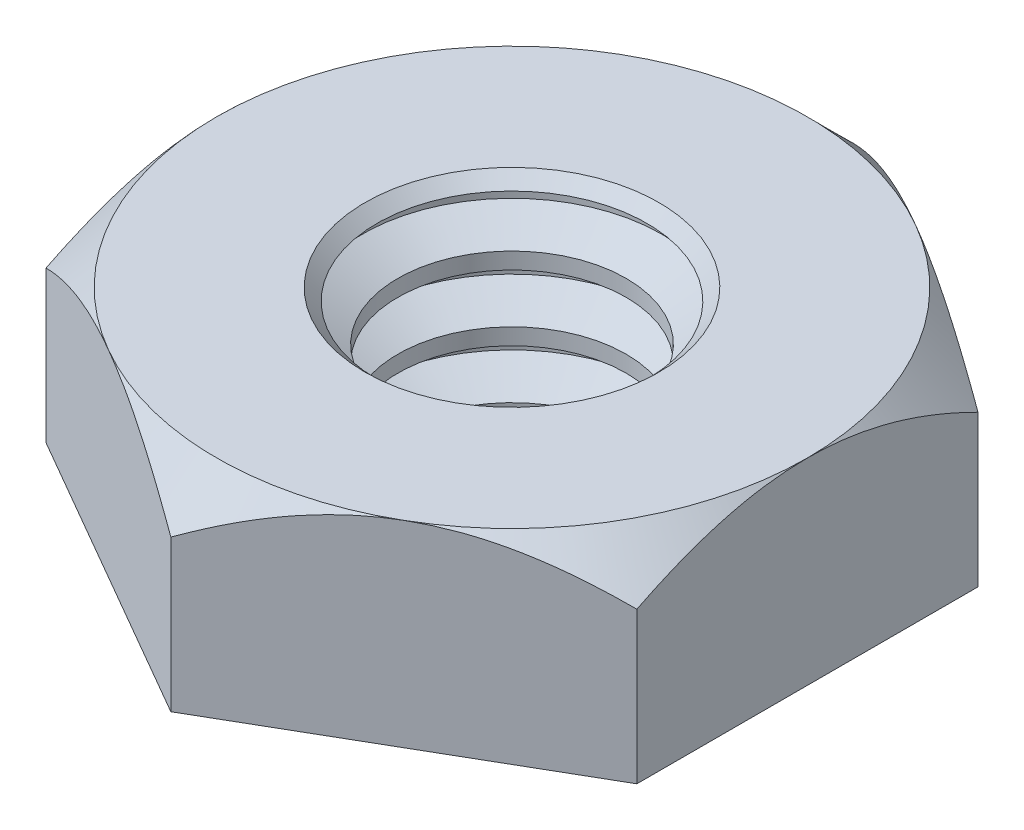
ISO-10303-21;
HEADER;
FILE_DESCRIPTION(('STEP AP214'),'2;1');
FILE_NAME('part.step','',(''),(''),'','','');
FILE_SCHEMA(('AUTOMOTIVE_DESIGN { 1 0 10303 214 1 1 1 1 }'));
ENDSEC;
DATA;
#1=APPLICATION_CONTEXT('core data for automotive mechanical design processes');
#2=APPLICATION_PROTOCOL_DEFINITION('international standard','automotive_design',2000,#1);
#3=PRODUCT_CONTEXT('',#1,'mechanical');
#4=PRODUCT('Part','Part','',(#3));
#5=PRODUCT_RELATED_PRODUCT_CATEGORY('part','',(#4));
#6=PRODUCT_DEFINITION_FORMATION('','',#4);
#7=PRODUCT_DEFINITION_CONTEXT('part definition',#1,'design');
#8=PRODUCT_DEFINITION('design','',#6,#7);
#9=PRODUCT_DEFINITION_SHAPE('','',#8);
#10=(LENGTH_UNIT() NAMED_UNIT(*) SI_UNIT(.MILLI.,.METRE.));
#11=(NAMED_UNIT(*) PLANE_ANGLE_UNIT() SI_UNIT($,.RADIAN.));
#12=(NAMED_UNIT(*) SI_UNIT($,.STERADIAN.) SOLID_ANGLE_UNIT());
#13=UNCERTAINTY_MEASURE_WITH_UNIT(LENGTH_MEASURE(1.E-05),#10,'distance_accuracy_value','');
#14=(GEOMETRIC_REPRESENTATION_CONTEXT(3) GLOBAL_UNCERTAINTY_ASSIGNED_CONTEXT((#13)) GLOBAL_UNIT_ASSIGNED_CONTEXT((#10,
#11,#12)) REPRESENTATION_CONTEXT('',''));
#15=CARTESIAN_POINT('',(0.,0.,0.));
#16=DIRECTION('',(0.,0.,1.));
#17=DIRECTION('',(1.,0.,0.));
#18=AXIS2_PLACEMENT_3D('',#15,#16,#17);
#19=CARTESIAN_POINT('',(0.,0.,-5.49926131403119));
#20=DIRECTION('',(0.,1.,0.));
#21=DIRECTION('',(0.,0.,1.));
#22=AXIS2_PLACEMENT_3D('',#19,#20,#21);
#23=PLANE('',#22);
#24=DIRECTION('',(-0.866025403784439,0.,-0.5));
#25=VECTOR('',#24,1.);
#26=CARTESIAN_POINT('',(4.7625,0.,-2.74963065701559));
#27=LINE('',#26,#25);
#28=CARTESIAN_POINT('',(4.7625,0.,-2.74963065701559));
#29=VERTEX_POINT('',#28);
#30=CARTESIAN_POINT('',(0.,0.,-5.49926131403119));
#31=VERTEX_POINT('',#30);
#32=EDGE_CURVE('E235',#29,#31,#27,.T.);
#33=ORIENTED_EDGE('',*,*,#32,.F.);
#34=DIRECTION('',(0.,0.,-1.));
#35=VECTOR('',#34,1.);
#36=CARTESIAN_POINT('',(4.7625,0.,2.74963065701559));
#37=LINE('',#36,#35);
#38=CARTESIAN_POINT('',(4.7625,0.,2.74963065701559));
#39=VERTEX_POINT('',#38);
#40=EDGE_CURVE('E283',#39,#29,#37,.T.);
#41=ORIENTED_EDGE('',*,*,#40,.F.);
#42=DIRECTION('',(0.866025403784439,0.,-0.5));
#43=VECTOR('',#42,1.);
#44=CARTESIAN_POINT('',(0.,0.,5.49926131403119));
#45=LINE('',#44,#43);
#46=CARTESIAN_POINT('',(0.,0.,5.49926131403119));
#47=VERTEX_POINT('',#46);
#48=EDGE_CURVE('E282',#47,#39,#45,.T.);
#49=ORIENTED_EDGE('',*,*,#48,.F.);
#50=DIRECTION('',(0.866025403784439,0.,0.5));
#51=VECTOR('',#50,1.);
#52=CARTESIAN_POINT('',(-4.7625,0.,2.74963065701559));
#53=LINE('',#52,#51);
#54=CARTESIAN_POINT('',(-4.7625,0.,2.74963065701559));
#55=VERTEX_POINT('',#54);
#56=EDGE_CURVE('E127',#55,#47,#53,.T.);
#57=ORIENTED_EDGE('',*,*,#56,.F.);
#58=DIRECTION('',(0.,0.,1.));
#59=VECTOR('',#58,1.);
#60=CARTESIAN_POINT('',(-4.7625,0.,-2.74963065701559));
#61=LINE('',#60,#59);
#62=CARTESIAN_POINT('',(-4.7625,0.,-2.74963065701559));
#63=VERTEX_POINT('',#62);
#64=EDGE_CURVE('E288',#63,#55,#61,.T.);
#65=ORIENTED_EDGE('',*,*,#64,.F.);
#66=DIRECTION('',(-0.866025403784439,0.,0.5));
#67=VECTOR('',#66,1.);
#68=CARTESIAN_POINT('',(0.,0.,-5.49926131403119));
#69=LINE('',#68,#67);
#70=EDGE_CURVE('E291',#31,#63,#69,.T.);
#71=ORIENTED_EDGE('',*,*,#70,.F.);
#72=EDGE_LOOP('',(#33,#41,#49,#57,#65,#71));
#73=FACE_BOUND('',#72,.T.);
#74=CARTESIAN_POINT('',(0.,0.,0.));
#75=DIRECTION('',(0.,1.,0.));
#76=DIRECTION('',(0.,0.,1.));
#77=AXIS2_PLACEMENT_3D('',#74,#75,#76);
#78=CIRCLE('',#77,1.84016027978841);
#79=CARTESIAN_POINT('',(0.,0.,1.84016027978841));
#80=VERTEX_POINT('',#79);
#81=EDGE_CURVE('E238',#80,#80,#78,.T.);
#82=ORIENTED_EDGE('',*,*,#81,.T.);
#83=EDGE_LOOP('',(#82));
#84=FACE_BOUND('',#83,.T.);
#85=ADVANCED_FACE('F33',(#73,#84),#23,.F.);
#86=CARTESIAN_POINT('',(0.,3.175,-5.49926131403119));
#87=DIRECTION('',(0.,1.,0.));
#88=DIRECTION('',(0.,0.,1.));
#89=AXIS2_PLACEMENT_3D('',#86,#87,#88);
#90=PLANE('',#89);
#91=CARTESIAN_POINT('',(0.,3.175,0.));
#92=DIRECTION('',(0.,1.,0.));
#93=DIRECTION('',(0.,0.,1.));
#94=AXIS2_PLACEMENT_3D('',#91,#92,#93);
#95=CIRCLE('',#94,2.36932694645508);
#96=CARTESIAN_POINT('',(0.,3.175,2.36932694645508));
#97=VERTEX_POINT('',#96);
#98=EDGE_CURVE('E11',#97,#97,#95,.F.);
#99=ORIENTED_EDGE('',*,*,#98,.T.);
#100=EDGE_LOOP('',(#99));
#101=FACE_BOUND('',#100,.T.);
#102=CARTESIAN_POINT('',(0.,3.175,0.));
#103=DIRECTION('',(0.,1.,0.));
#104=DIRECTION('',(0.,0.,1.));
#105=AXIS2_PLACEMENT_3D('',#102,#103,#104);
#106=CIRCLE('',#105,4.7625);
#107=CARTESIAN_POINT('',(-2.38125,3.175,4.12444598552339));
#108=VERTEX_POINT('',#107);
#109=CARTESIAN_POINT('',(2.38125,3.175,4.12444598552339));
#110=VERTEX_POINT('',#109);
#111=EDGE_CURVE('E109',#108,#110,#106,.T.);
#112=ORIENTED_EDGE('',*,*,#111,.T.);
#113=CARTESIAN_POINT('',(0.,3.175,0.));
#114=DIRECTION('',(0.,1.,0.));
#115=DIRECTION('',(0.,0.,1.));
#116=AXIS2_PLACEMENT_3D('',#113,#114,#115);
#117=CIRCLE('',#116,4.7625);
#118=CARTESIAN_POINT('',(4.7625,3.175,0.));
#119=VERTEX_POINT('',#118);
#120=EDGE_CURVE('E49',#110,#119,#117,.T.);
#121=ORIENTED_EDGE('',*,*,#120,.T.);
#122=CARTESIAN_POINT('',(2.38125,3.175,-4.12444598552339));
#123=VERTEX_POINT('',#122);
#124=EDGE_CURVE('E142',#119,#123,#106,.T.);
#125=ORIENTED_EDGE('',*,*,#124,.T.);
#126=CARTESIAN_POINT('',(-2.38125,3.175,-4.12444598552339));
#127=VERTEX_POINT('',#126);
#128=EDGE_CURVE('E146',#123,#127,#106,.T.);
#129=ORIENTED_EDGE('',*,*,#128,.T.);
#130=CARTESIAN_POINT('',(-4.7625,3.175,0.));
#131=VERTEX_POINT('',#130);
#132=EDGE_CURVE('E149',#127,#131,#106,.T.);
#133=ORIENTED_EDGE('',*,*,#132,.T.);
#134=EDGE_CURVE('E141',#131,#108,#106,.T.);
#135=ORIENTED_EDGE('',*,*,#134,.T.);
#136=EDGE_LOOP('',(#112,#121,#125,#129,#133,#135));
#137=FACE_BOUND('',#136,.T.);
#138=ADVANCED_FACE('F156',(#101,#137),#90,.T.);
#139=CARTESIAN_POINT('',(4.7625,3.175,-2.74963065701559));
#140=DIRECTION('',(-0.5,0.,0.866025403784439));
#141=DIRECTION('',(0.866025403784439,0.,0.5));
#142=AXIS2_PLACEMENT_3D('',#139,#140,#141);
#143=PLANE('',#142);
#144=CARTESIAN_POINT('',(4.7627,2.43812321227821,-2.74951518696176));
#145=CARTESIAN_POINT('',(4.68081065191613,2.48539793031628,-2.79679402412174));
#146=CARTESIAN_POINT('',(4.5982918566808,2.53122188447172,-2.84443627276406));
#147=CARTESIAN_POINT('',(4.43187187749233,2.61952693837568,-2.94051889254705));
#148=CARTESIAN_POINT('',(4.34796996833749,2.66200621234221,-2.98895968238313));
#149=CARTESIAN_POINT('',(4.09322481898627,2.78412729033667,-3.1360368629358));
#150=CARTESIAN_POINT('',(3.92022499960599,2.85793135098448,-3.23591835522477));
#151=CARTESIAN_POINT('',(3.57135699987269,2.98431583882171,-3.43733738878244));
#152=CARTESIAN_POINT('',(3.39557799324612,3.03721468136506,-3.53882344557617));
#153=CARTESIAN_POINT('',(3.12901952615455,3.09840573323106,-3.69272104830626));
#154=CARTESIAN_POINT('',(3.03977424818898,3.11576836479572,-3.74424683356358));
#155=CARTESIAN_POINT('',(2.8605280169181,3.14404831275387,-3.84773469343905));
#156=CARTESIAN_POINT('',(2.77052717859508,3.15496659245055,-3.89969670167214));
#157=CARTESIAN_POINT('',(2.55120982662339,3.17327251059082,-4.02631963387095));
#158=CARTESIAN_POINT('',(2.42165701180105,3.17711359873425,-4.1011169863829));
#159=CARTESIAN_POINT('',(2.16278485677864,3.17066760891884,-4.25057689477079));
#160=CARTESIAN_POINT('',(2.03346561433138,3.16037557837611,-4.32523939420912));
#161=CARTESIAN_POINT('',(1.77604630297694,3.12627002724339,-4.47386050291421));
#162=CARTESIAN_POINT('',(1.64794776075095,3.10244138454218,-4.54781823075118));
#163=CARTESIAN_POINT('',(1.39395236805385,3.0425580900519,-4.69446253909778));
#164=CARTESIAN_POINT('',(1.26805534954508,3.00650437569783,-4.76714921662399));
#165=CARTESIAN_POINT('',(1.04456117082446,2.93232926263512,-4.89618364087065));
#166=CARTESIAN_POINT('',(0.946469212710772,2.89615832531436,-4.95281705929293));
#167=CARTESIAN_POINT('',(0.752046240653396,2.81798737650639,-5.0650672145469));
#168=CARTESIAN_POINT('',(0.655715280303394,2.77598718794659,-5.12068392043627));
#169=CARTESIAN_POINT('',(0.465117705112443,2.68709929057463,-5.23072548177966));
#170=CARTESIAN_POINT('',(0.370845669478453,2.64022695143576,-5.28515346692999));
#171=CARTESIAN_POINT('',(0.184047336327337,2.54221019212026,-5.39300153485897));
#172=CARTESIAN_POINT('',(0.0915200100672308,2.49106839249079,-5.44642221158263));
#173=CARTESIAN_POINT('',(-0.000200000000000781,2.43812321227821,-5.49937678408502));
#174=B_SPLINE_CURVE_WITH_KNOTS('',3,(#144,#145,#146,#147,#148,#149,#150,#151,#152,#153,#154,
#155,#156,#157,#158,#159,#160,#161,#162,#163,#164,#165,#166,#167,#168,#169,#170,#171,#172,#173),
.UNSPECIFIED.,.F.,.F.,(4,2,2,2,2,2,2,2,2,2,2,2,2,2,4),(0.,0.317131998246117,0.634435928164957,
1.2724696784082,1.90037160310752,2.21370673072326,2.52699500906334,2.97522950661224,
3.42362111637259,3.87251462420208,4.32137371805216,4.67791268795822,5.03446249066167,
5.38991982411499,5.74516056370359),.UNSPECIFIED.);
#175=CARTESIAN_POINT('',(4.7625,2.43823868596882,-2.7496306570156));
#176=VERTEX_POINT('',#175);
#177=EDGE_CURVE('E293',#176,#123,#174,.T.);
#178=ORIENTED_EDGE('',*,*,#177,.F.);
#179=DIRECTION('',(0.,-1.,0.));
#180=VECTOR('',#179,1.);
#181=CARTESIAN_POINT('',(4.7625,3.175,-2.74963065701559));
#182=LINE('',#181,#180);
#183=EDGE_CURVE('E134',#176,#29,#182,.T.);
#184=ORIENTED_EDGE('',*,*,#183,.T.);
#185=ORIENTED_EDGE('',*,*,#32,.T.);
#186=DIRECTION('',(0.,-1.,0.));
#187=VECTOR('',#186,1.);
#188=CARTESIAN_POINT('',(0.,3.175,-5.49926131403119));
#189=LINE('',#188,#187);
#190=CARTESIAN_POINT('',(0.,2.43823868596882,-5.49926131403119));
#191=VERTEX_POINT('',#190);
#192=EDGE_CURVE('E139',#191,#31,#189,.T.);
#193=ORIENTED_EDGE('',*,*,#192,.F.);
#194=EDGE_CURVE('E207',#123,#191,#174,.T.);
#195=ORIENTED_EDGE('',*,*,#194,.F.);
#196=EDGE_LOOP('',(#178,#184,#185,#193,#195));
#197=FACE_BOUND('',#196,.T.);
#198=ADVANCED_FACE('F35',(#197),#143,.F.);
#199=CARTESIAN_POINT('',(0.,3.175,-5.49926131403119));
#200=DIRECTION('',(0.5,0.,0.866025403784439));
#201=DIRECTION('',(0.866025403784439,0.,-0.5));
#202=AXIS2_PLACEMENT_3D('',#199,#200,#201);
#203=PLANE('',#202);
#204=CARTESIAN_POINT('',(0.000199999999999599,2.43812321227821,-5.49937678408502));
#205=CARTESIAN_POINT('',(-0.0816893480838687,2.48539793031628,-5.45209794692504));
#206=CARTESIAN_POINT('',(-0.164208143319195,2.53122188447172,-5.40445569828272));
#207=CARTESIAN_POINT('',(-0.330628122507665,2.61952693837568,-5.30837307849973));
#208=CARTESIAN_POINT('',(-0.41453003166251,2.66200621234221,-5.25993228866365));
#209=CARTESIAN_POINT('',(-0.669275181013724,2.78412729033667,-5.11285510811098));
#210=CARTESIAN_POINT('',(-0.842275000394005,2.85793135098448,-5.01297361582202));
#211=CARTESIAN_POINT('',(-1.19114300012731,2.98431583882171,-4.81155458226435));
#212=CARTESIAN_POINT('',(-1.36692200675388,3.03721468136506,-4.71006852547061));
#213=CARTESIAN_POINT('',(-1.63348047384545,3.09840573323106,-4.55617092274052));
#214=CARTESIAN_POINT('',(-1.72272575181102,3.11576836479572,-4.5046451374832));
#215=CARTESIAN_POINT('',(-1.90197198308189,3.14404831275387,-4.40115727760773));
#216=CARTESIAN_POINT('',(-1.99197282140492,3.15496659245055,-4.34919526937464));
#217=CARTESIAN_POINT('',(-2.21129017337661,3.17327251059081,-4.22257233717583));
#218=CARTESIAN_POINT('',(-2.34084298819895,3.17711359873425,-4.14777498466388));
#219=CARTESIAN_POINT('',(-2.59971514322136,3.17066760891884,-3.99831507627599));
#220=CARTESIAN_POINT('',(-2.72903438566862,3.16037557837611,-3.92365257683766));
#221=CARTESIAN_POINT('',(-2.98645369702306,3.12627002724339,-3.77503146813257));
#222=CARTESIAN_POINT('',(-3.11455223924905,3.10244138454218,-3.7010737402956));
#223=CARTESIAN_POINT('',(-3.36854763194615,3.04255809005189,-3.554429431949));
#224=CARTESIAN_POINT('',(-3.49444465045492,3.00650437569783,-3.48174275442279));
#225=CARTESIAN_POINT('',(-3.71793882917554,2.93232926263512,-3.35270833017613));
#226=CARTESIAN_POINT('',(-3.81603078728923,2.89615832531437,-3.29607491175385));
#227=CARTESIAN_POINT('',(-4.0104537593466,2.81798737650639,-3.18382475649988));
#228=CARTESIAN_POINT('',(-4.10678471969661,2.77598718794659,-3.12820805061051));
#229=CARTESIAN_POINT('',(-4.29738229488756,2.68709929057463,-3.01816648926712));
#230=CARTESIAN_POINT('',(-4.39165433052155,2.64022695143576,-2.96373850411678));
#231=CARTESIAN_POINT('',(-4.57845266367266,2.54221019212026,-2.85589043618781));
#232=CARTESIAN_POINT('',(-4.67097998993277,2.49106839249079,-2.80246975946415));
#233=CARTESIAN_POINT('',(-4.7627,2.43812321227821,-2.74951518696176));
#234=B_SPLINE_CURVE_WITH_KNOTS('',3,(#204,#205,#206,#207,#208,#209,#210,#211,#212,#213,#214,
#215,#216,#217,#218,#219,#220,#221,#222,#223,#224,#225,#226,#227,#228,#229,#230,#231,#232,#233),
.UNSPECIFIED.,.F.,.F.,(4,2,2,2,2,2,2,2,2,2,2,2,2,2,4),(0.,0.317131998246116,0.634435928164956,
1.2724696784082,1.90037160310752,2.21370673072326,2.52699500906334,2.97522950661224,
3.42362111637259,3.87251462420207,4.32137371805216,4.67791268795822,5.03446249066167,
5.38991982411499,5.74516056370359),.UNSPECIFIED.);
#235=EDGE_CURVE('E206',#191,#127,#234,.T.);
#236=ORIENTED_EDGE('',*,*,#235,.F.);
#237=ORIENTED_EDGE('',*,*,#192,.T.);
#238=ORIENTED_EDGE('',*,*,#70,.T.);
#239=DIRECTION('',(0.,-1.,0.));
#240=VECTOR('',#239,1.);
#241=CARTESIAN_POINT('',(-4.7625,3.175,-2.74963065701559));
#242=LINE('',#241,#240);
#243=CARTESIAN_POINT('',(-4.7625,2.43823868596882,-2.74963065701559));
#244=VERTEX_POINT('',#243);
#245=EDGE_CURVE('E132',#244,#63,#242,.T.);
#246=ORIENTED_EDGE('',*,*,#245,.F.);
#247=EDGE_CURVE('E202',#127,#244,#234,.T.);
#248=ORIENTED_EDGE('',*,*,#247,.F.);
#249=EDGE_LOOP('',(#236,#237,#238,#246,#248));
#250=FACE_BOUND('',#249,.T.);
#251=ADVANCED_FACE('F212',(#250),#203,.F.);
#252=CARTESIAN_POINT('',(-4.7625,3.175,-2.74963065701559));
#253=DIRECTION('',(1.,0.,0.));
#254=DIRECTION('',(0.,0.,-1.));
#255=AXIS2_PLACEMENT_3D('',#252,#253,#254);
#256=PLANE('',#255);
#257=CARTESIAN_POINT('',(-4.7625,0.480359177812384,-5.73825260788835));
#258=CARTESIAN_POINT('',(-4.7625,0.58701337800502,-5.59961911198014));
#259=CARTESIAN_POINT('',(-4.7625,0.692711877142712,-5.46023863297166));
#260=CARTESIAN_POINT('',(-4.7625,0.901760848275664,-5.1796783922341));
#261=CARTESIAN_POINT('',(-4.7625,1.00511075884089,-5.03849821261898));
#262=CARTESIAN_POINT('',(-4.7625,1.2097614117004,-4.75300155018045));
#263=CARTESIAN_POINT('',(-4.7625,1.31104019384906,-4.60866927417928));
#264=CARTESIAN_POINT('',(-4.7625,1.51007322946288,-4.31760261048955));
#265=CARTESIAN_POINT('',(-4.7625,1.6078277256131,-4.17086838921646));
#266=CARTESIAN_POINT('',(-4.7625,1.80507075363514,-3.86520042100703));
#267=CARTESIAN_POINT('',(-4.7625,1.90427620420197,-3.70608308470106));
#268=CARTESIAN_POINT('',(-4.7625,2.09652957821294,-3.38411178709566));
#269=CARTESIAN_POINT('',(-4.7625,2.18957646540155,-3.22125720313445));
#270=CARTESIAN_POINT('',(-4.7625,2.36753114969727,-2.89176685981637));
#271=CARTESIAN_POINT('',(-4.7625,2.4524628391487,-2.72514410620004));
#272=CARTESIAN_POINT('',(-4.7625,2.61228425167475,-2.3871883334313));
#273=CARTESIAN_POINT('',(-4.7625,2.68717871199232,-2.2158575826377));
#274=CARTESIAN_POINT('',(-4.7625,2.81744904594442,-1.88527007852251));
#275=CARTESIAN_POINT('',(-4.7625,2.87402159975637,-1.72648972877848));
#276=CARTESIAN_POINT('',(-4.7625,2.97445731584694,-1.40488378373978));
#277=CARTESIAN_POINT('',(-4.7625,3.01831966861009,-1.24205793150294));
#278=CARTESIAN_POINT('',(-4.7625,3.09022963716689,-0.916169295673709));
#279=CARTESIAN_POINT('',(-4.7625,3.11856448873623,-0.753170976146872));
#280=CARTESIAN_POINT('',(-4.7625,3.1588283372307,-0.425149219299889));
#281=CARTESIAN_POINT('',(-4.7625,3.17076073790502,-0.260126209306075));
#282=CARTESIAN_POINT('',(-4.7625,3.17720325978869,0.0630444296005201));
#283=CARTESIAN_POINT('',(-4.7625,3.17245171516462,0.221177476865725));
#284=CARTESIAN_POINT('',(-4.7625,3.14748365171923,0.536209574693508));
#285=CARTESIAN_POINT('',(-4.7625,3.12726572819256,0.693108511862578));
#286=CARTESIAN_POINT('',(-4.7625,3.07216443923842,1.00719592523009));
#287=CARTESIAN_POINT('',(-4.7625,3.03702215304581,1.16433820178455));
#288=CARTESIAN_POINT('',(-4.7625,2.95402178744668,1.47516220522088));
#289=CARTESIAN_POINT('',(-4.7625,2.90616443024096,1.62884412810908));
#290=CARTESIAN_POINT('',(-4.7625,2.79677235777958,1.94121388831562));
#291=CARTESIAN_POINT('',(-4.7625,2.73460754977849,2.09967854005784));
#292=CARTESIAN_POINT('',(-4.7625,2.60067388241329,2.41253183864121));
#293=CARTESIAN_POINT('',(-4.7625,2.52890069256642,2.56691860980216));
#294=CARTESIAN_POINT('',(-4.7625,2.37745234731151,2.87234524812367));
#295=CARTESIAN_POINT('',(-4.7625,2.29775285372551,3.02337294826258));
#296=CARTESIAN_POINT('',(-4.7625,2.13220577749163,3.3219676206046));
#297=CARTESIAN_POINT('',(-4.7625,2.04635914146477,3.46953512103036));
#298=CARTESIAN_POINT('',(-4.7625,1.874079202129,3.75444944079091));
#299=CARTESIAN_POINT('',(-4.7625,1.7878842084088,3.89194112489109));
#300=CARTESIAN_POINT('',(-4.7625,1.61182532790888,4.16456228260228));
#301=CARTESIAN_POINT('',(-4.7625,1.52196116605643,4.29969157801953));
#302=CARTESIAN_POINT('',(-4.7625,1.33994982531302,4.56681060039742));
#303=CARTESIAN_POINT('',(-4.7625,1.24782676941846,4.6988168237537));
#304=CARTESIAN_POINT('',(-4.7625,1.06111116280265,4.96101832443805));
#305=CARTESIAN_POINT('',(-4.7625,0.966519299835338,5.09121409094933));
#306=CARTESIAN_POINT('',(-4.7625,0.870916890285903,5.22065039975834));
#307=B_SPLINE_CURVE_WITH_KNOTS('',3,(#257,#258,#259,#260,#261,#262,#263,#264,#265,#266,#267,
#268,#269,#270,#271,#272,#273,#274,#275,#276,#277,#278,#279,#280,#281,#282,#283,#284,#285,#286,
#287,#288,#289,#290,#291,#292,#293,#294,#295,#296,#297,#298,#299,#300,#301,#302,#303,#304,#305,
#306),.UNSPECIFIED.,.F.,.F.,(4,2,2,2,2,2,2,2,2,2,2,2,2,2,2,2,2,2,2,2,2,2,2,2,4),(0.,
0.524746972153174,1.04961809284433,1.57853849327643,2.10742240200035,2.66984197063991,
3.23235593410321,3.79315915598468,4.35369675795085,4.85893363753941,5.36420268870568,
5.85977907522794,6.3552526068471,6.82908097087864,7.30295237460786,7.78540424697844,
8.26782872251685,8.7781033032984,9.28860864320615,9.80073298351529,10.3127786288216,
10.7995387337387,11.2863353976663,11.7692236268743,12.2519787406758),.UNSPECIFIED.);
#308=EDGE_CURVE('E161',#244,#131,#307,.T.);
#309=ORIENTED_EDGE('',*,*,#308,.F.);
#310=ORIENTED_EDGE('',*,*,#245,.T.);
#311=ORIENTED_EDGE('',*,*,#64,.T.);
#312=DIRECTION('',(0.,-1.,0.));
#313=VECTOR('',#312,1.);
#314=CARTESIAN_POINT('',(-4.7625,3.175,2.74963065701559));
#315=LINE('',#314,#313);
#316=CARTESIAN_POINT('',(-4.7625,2.43823868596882,2.7496306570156));
#317=VERTEX_POINT('',#316);
#318=EDGE_CURVE('E129',#317,#55,#315,.T.);
#319=ORIENTED_EDGE('',*,*,#318,.F.);
#320=EDGE_CURVE('E159',#131,#317,#307,.T.);
#321=ORIENTED_EDGE('',*,*,#320,.F.);
#322=EDGE_LOOP('',(#309,#310,#311,#319,#321));
#323=FACE_BOUND('',#322,.T.);
#324=ADVANCED_FACE('F215',(#323),#256,.F.);
#325=CARTESIAN_POINT('',(-4.7625,3.175,2.74963065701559));
#326=DIRECTION('',(0.5,0.,-0.866025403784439));
#327=DIRECTION('',(-0.866025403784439,0.,-0.5));
#328=AXIS2_PLACEMENT_3D('',#325,#326,#327);
#329=PLANE('',#328);
#330=CARTESIAN_POINT('',(-4.7627,2.43812321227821,2.74951518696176));
#331=CARTESIAN_POINT('',(-4.68081065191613,2.48539793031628,2.79679402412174));
#332=CARTESIAN_POINT('',(-4.59829185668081,2.53122188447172,2.84443627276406));
#333=CARTESIAN_POINT('',(-4.43187187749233,2.61952693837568,2.94051889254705));
#334=CARTESIAN_POINT('',(-4.34796996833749,2.66200621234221,2.98895968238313));
#335=CARTESIAN_POINT('',(-4.09322481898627,2.78412729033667,3.1360368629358));
#336=CARTESIAN_POINT('',(-3.92022499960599,2.85793135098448,3.23591835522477));
#337=CARTESIAN_POINT('',(-3.57135699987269,2.98431583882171,3.43733738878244));
#338=CARTESIAN_POINT('',(-3.39557799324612,3.03721468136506,3.53882344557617));
#339=CARTESIAN_POINT('',(-3.12901952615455,3.09840573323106,3.69272104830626));
#340=CARTESIAN_POINT('',(-3.03977424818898,3.11576836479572,3.74424683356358));
#341=CARTESIAN_POINT('',(-2.8605280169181,3.14404831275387,3.84773469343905));
#342=CARTESIAN_POINT('',(-2.77052717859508,3.15496659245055,3.89969670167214));
#343=CARTESIAN_POINT('',(-2.55120982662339,3.17327251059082,4.02631963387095));
#344=CARTESIAN_POINT('',(-2.42165701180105,3.17711359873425,4.1011169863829));
#345=CARTESIAN_POINT('',(-2.16278485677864,3.17066760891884,4.25057689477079));
#346=CARTESIAN_POINT('',(-2.03346561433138,3.16037557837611,4.32523939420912));
#347=CARTESIAN_POINT('',(-1.77604630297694,3.12627002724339,4.47386050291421));
#348=CARTESIAN_POINT('',(-1.64794776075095,3.10244138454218,4.54781823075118));
#349=CARTESIAN_POINT('',(-1.39395236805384,3.0425580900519,4.69446253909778));
#350=CARTESIAN_POINT('',(-1.26805534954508,3.00650437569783,4.76714921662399));
#351=CARTESIAN_POINT('',(-1.04456117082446,2.93232926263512,4.89618364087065));
#352=CARTESIAN_POINT('',(-0.946469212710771,2.89615832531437,4.95281705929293));
#353=CARTESIAN_POINT('',(-0.752046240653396,2.81798737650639,5.0650672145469));
#354=CARTESIAN_POINT('',(-0.655715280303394,2.77598718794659,5.12068392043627));
#355=CARTESIAN_POINT('',(-0.465117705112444,2.68709929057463,5.23072548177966));
#356=CARTESIAN_POINT('',(-0.370845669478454,2.64022695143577,5.28515346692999));
#357=CARTESIAN_POINT('',(-0.184047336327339,2.54221019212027,5.39300153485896));
#358=CARTESIAN_POINT('',(-0.0915200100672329,2.49106839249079,5.44642221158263));
#359=CARTESIAN_POINT('',(0.000199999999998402,2.43812321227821,5.49937678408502));
#360=B_SPLINE_CURVE_WITH_KNOTS('',3,(#330,#331,#332,#333,#334,#335,#336,#337,#338,#339,#340,
#341,#342,#343,#344,#345,#346,#347,#348,#349,#350,#351,#352,#353,#354,#355,#356,#357,#358,#359),
.UNSPECIFIED.,.F.,.F.,(4,2,2,2,2,2,2,2,2,2,2,2,2,2,4),(0.,0.317131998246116,0.634435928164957,
1.2724696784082,1.90037160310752,2.21370673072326,2.52699500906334,2.97522950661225,
3.42362111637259,3.87251462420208,4.32137371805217,4.67791268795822,5.03446249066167,
5.38991982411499,5.74516056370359),.UNSPECIFIED.);
#361=EDGE_CURVE('E114',#317,#108,#360,.T.);
#362=ORIENTED_EDGE('',*,*,#361,.F.);
#363=ORIENTED_EDGE('',*,*,#318,.T.);
#364=ORIENTED_EDGE('',*,*,#56,.T.);
#365=DIRECTION('',(0.,-1.,0.));
#366=VECTOR('',#365,1.);
#367=CARTESIAN_POINT('',(0.,3.175,5.49926131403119));
#368=LINE('',#367,#366);
#369=CARTESIAN_POINT('',(0.,2.43823868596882,5.49926131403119));
#370=VERTEX_POINT('',#369);
#371=EDGE_CURVE('E120',#370,#47,#368,.T.);
#372=ORIENTED_EDGE('',*,*,#371,.F.);
#373=EDGE_CURVE('E105',#108,#370,#360,.T.);
#374=ORIENTED_EDGE('',*,*,#373,.F.);
#375=EDGE_LOOP('',(#362,#363,#364,#372,#374));
#376=FACE_BOUND('',#375,.T.);
#377=ADVANCED_FACE('F125',(#376),#329,.F.);
#378=CARTESIAN_POINT('',(0.,3.175,5.49926131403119));
#379=DIRECTION('',(-0.5,0.,-0.866025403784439));
#380=DIRECTION('',(-0.866025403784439,0.,0.5));
#381=AXIS2_PLACEMENT_3D('',#378,#379,#380);
#382=PLANE('',#381);
#383=CARTESIAN_POINT('',(-0.000200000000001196,2.43812321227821,5.49937678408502));
#384=CARTESIAN_POINT('',(0.0816893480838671,2.48539793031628,5.45209794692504));
#385=CARTESIAN_POINT('',(0.164208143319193,2.53122188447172,5.40445569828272));
#386=CARTESIAN_POINT('',(0.330628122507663,2.61952693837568,5.30837307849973));
#387=CARTESIAN_POINT('',(0.414530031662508,2.66200621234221,5.25993228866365));
#388=CARTESIAN_POINT('',(0.669275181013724,2.78412729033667,5.11285510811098));
#389=CARTESIAN_POINT('',(0.842275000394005,2.85793135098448,5.01297361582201));
#390=CARTESIAN_POINT('',(1.19114300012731,2.98431583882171,4.81155458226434));
#391=CARTESIAN_POINT('',(1.36692200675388,3.03721468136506,4.71006852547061));
#392=CARTESIAN_POINT('',(1.63348047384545,3.09840573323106,4.55617092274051));
#393=CARTESIAN_POINT('',(1.72272575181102,3.11576836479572,4.50464513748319));
#394=CARTESIAN_POINT('',(1.9019719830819,3.14404831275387,4.40115727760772));
#395=CARTESIAN_POINT('',(1.99197282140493,3.15496659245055,4.34919526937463));
#396=CARTESIAN_POINT('',(2.21129017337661,3.17327251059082,4.22257233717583));
#397=CARTESIAN_POINT('',(2.34084298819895,3.17711359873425,4.14777498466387));
#398=CARTESIAN_POINT('',(2.59971514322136,3.17066760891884,3.99831507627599));
#399=CARTESIAN_POINT('',(2.72903438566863,3.16037557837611,3.92365257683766));
#400=CARTESIAN_POINT('',(2.98645369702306,3.12627002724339,3.77503146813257));
#401=CARTESIAN_POINT('',(3.11455223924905,3.10244138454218,3.70107374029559));
#402=CARTESIAN_POINT('',(3.36854763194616,3.04255809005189,3.554429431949));
#403=CARTESIAN_POINT('',(3.49444465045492,3.00650437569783,3.48174275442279));
#404=CARTESIAN_POINT('',(3.71793882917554,2.93232926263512,3.35270833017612));
#405=CARTESIAN_POINT('',(3.81603078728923,2.89615832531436,3.29607491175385));
#406=CARTESIAN_POINT('',(4.0104537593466,2.81798737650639,3.18382475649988));
#407=CARTESIAN_POINT('',(4.10678471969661,2.77598718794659,3.12820805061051));
#408=CARTESIAN_POINT('',(4.29738229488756,2.68709929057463,3.01816648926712));
#409=CARTESIAN_POINT('',(4.39165433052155,2.64022695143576,2.96373850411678));
#410=CARTESIAN_POINT('',(4.57845266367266,2.54221019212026,2.85589043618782));
#411=CARTESIAN_POINT('',(4.67097998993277,2.49106839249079,2.80246975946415));
#412=CARTESIAN_POINT('',(4.7627,2.43812321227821,2.74951518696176));
#413=B_SPLINE_CURVE_WITH_KNOTS('',3,(#383,#384,#385,#386,#387,#388,#389,#390,#391,#392,#393,
#394,#395,#396,#397,#398,#399,#400,#401,#402,#403,#404,#405,#406,#407,#408,#409,#410,#411,#412),
.UNSPECIFIED.,.F.,.F.,(4,2,2,2,2,2,2,2,2,2,2,2,2,2,4),(0.,0.317131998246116,0.634435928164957,
1.2724696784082,1.90037160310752,2.21370673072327,2.52699500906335,2.97522950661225,
3.42362111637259,3.87251462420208,4.32137371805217,4.67791268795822,5.03446249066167,
5.38991982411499,5.74516056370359),.UNSPECIFIED.);
#414=EDGE_CURVE('E108',#370,#110,#413,.T.);
#415=ORIENTED_EDGE('',*,*,#414,.F.);
#416=ORIENTED_EDGE('',*,*,#371,.T.);
#417=ORIENTED_EDGE('',*,*,#48,.T.);
#418=DIRECTION('',(0.,-1.,0.));
#419=VECTOR('',#418,1.);
#420=CARTESIAN_POINT('',(4.7625,3.175,2.74963065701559));
#421=LINE('',#420,#419);
#422=CARTESIAN_POINT('',(4.7625,2.43823868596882,2.7496306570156));
#423=VERTEX_POINT('',#422);
#424=EDGE_CURVE('E130',#423,#39,#421,.T.);
#425=ORIENTED_EDGE('',*,*,#424,.F.);
#426=EDGE_CURVE('E123',#110,#423,#413,.T.);
#427=ORIENTED_EDGE('',*,*,#426,.F.);
#428=EDGE_LOOP('',(#415,#416,#417,#425,#427));
#429=FACE_BOUND('',#428,.T.);
#430=ADVANCED_FACE('F118',(#429),#382,.F.);
#431=CARTESIAN_POINT('',(4.7625,3.175,2.74963065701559));
#432=DIRECTION('',(-1.,0.,0.));
#433=DIRECTION('',(0.,0.,1.));
#434=AXIS2_PLACEMENT_3D('',#431,#432,#433);
#435=PLANE('',#434);
#436=CARTESIAN_POINT('',(4.7625,0.480359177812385,-5.73825260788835));
#437=CARTESIAN_POINT('',(4.7625,0.587013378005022,-5.59961911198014));
#438=CARTESIAN_POINT('',(4.7625,0.692711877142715,-5.46023863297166));
#439=CARTESIAN_POINT('',(4.7625,0.901760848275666,-5.1796783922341));
#440=CARTESIAN_POINT('',(4.7625,1.00511075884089,-5.03849821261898));
#441=CARTESIAN_POINT('',(4.7625,1.2097614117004,-4.75300155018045));
#442=CARTESIAN_POINT('',(4.7625,1.31104019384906,-4.60866927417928));
#443=CARTESIAN_POINT('',(4.7625,1.51007322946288,-4.31760261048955));
#444=CARTESIAN_POINT('',(4.7625,1.6078277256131,-4.17086838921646));
#445=CARTESIAN_POINT('',(4.7625,1.80507075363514,-3.86520042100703));
#446=CARTESIAN_POINT('',(4.7625,1.90427620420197,-3.70608308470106));
#447=CARTESIAN_POINT('',(4.7625,2.09652957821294,-3.38411178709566));
#448=CARTESIAN_POINT('',(4.7625,2.18957646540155,-3.22125720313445));
#449=CARTESIAN_POINT('',(4.7625,2.36753114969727,-2.89176685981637));
#450=CARTESIAN_POINT('',(4.7625,2.4524628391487,-2.72514410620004));
#451=CARTESIAN_POINT('',(4.7625,2.61228425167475,-2.3871883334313));
#452=CARTESIAN_POINT('',(4.7625,2.68717871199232,-2.2158575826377));
#453=CARTESIAN_POINT('',(4.7625,2.81744904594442,-1.88527007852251));
#454=CARTESIAN_POINT('',(4.7625,2.87402159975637,-1.72648972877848));
#455=CARTESIAN_POINT('',(4.7625,2.97445731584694,-1.40488378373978));
#456=CARTESIAN_POINT('',(4.7625,3.01831966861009,-1.24205793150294));
#457=CARTESIAN_POINT('',(4.7625,3.09022963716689,-0.91616929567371));
#458=CARTESIAN_POINT('',(4.7625,3.11856448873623,-0.753170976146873));
#459=CARTESIAN_POINT('',(4.7625,3.1588283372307,-0.425149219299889));
#460=CARTESIAN_POINT('',(4.7625,3.17076073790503,-0.260126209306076));
#461=CARTESIAN_POINT('',(4.7625,3.17720325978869,0.0630444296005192));
#462=CARTESIAN_POINT('',(4.7625,3.17245171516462,0.221177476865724));
#463=CARTESIAN_POINT('',(4.7625,3.14748365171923,0.536209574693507));
#464=CARTESIAN_POINT('',(4.7625,3.12726572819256,0.693108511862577));
#465=CARTESIAN_POINT('',(4.7625,3.07216443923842,1.00719592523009));
#466=CARTESIAN_POINT('',(4.7625,3.03702215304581,1.16433820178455));
#467=CARTESIAN_POINT('',(4.7625,2.95402178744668,1.47516220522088));
#468=CARTESIAN_POINT('',(4.7625,2.90616443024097,1.62884412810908));
#469=CARTESIAN_POINT('',(4.7625,2.79677235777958,1.94121388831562));
#470=CARTESIAN_POINT('',(4.7625,2.73460754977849,2.09967854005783));
#471=CARTESIAN_POINT('',(4.7625,2.6006738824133,2.4125318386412));
#472=CARTESIAN_POINT('',(4.7625,2.52890069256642,2.56691860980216));
#473=CARTESIAN_POINT('',(4.7625,2.37745234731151,2.87234524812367));
#474=CARTESIAN_POINT('',(4.7625,2.29775285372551,3.02337294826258));
#475=CARTESIAN_POINT('',(4.7625,2.13220577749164,3.32196762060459));
#476=CARTESIAN_POINT('',(4.7625,2.04635914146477,3.46953512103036));
#477=CARTESIAN_POINT('',(4.7625,1.874079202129,3.7544494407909));
#478=CARTESIAN_POINT('',(4.7625,1.78788420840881,3.89194112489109));
#479=CARTESIAN_POINT('',(4.7625,1.61182532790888,4.16456228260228));
#480=CARTESIAN_POINT('',(4.7625,1.52196116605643,4.29969157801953));
#481=CARTESIAN_POINT('',(4.7625,1.33994982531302,4.56681060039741));
#482=CARTESIAN_POINT('',(4.7625,1.24782676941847,4.6988168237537));
#483=CARTESIAN_POINT('',(4.7625,1.06111116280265,4.96101832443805));
#484=CARTESIAN_POINT('',(4.7625,0.966519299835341,5.09121409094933));
#485=CARTESIAN_POINT('',(4.7625,0.870916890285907,5.22065039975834));
#486=B_SPLINE_CURVE_WITH_KNOTS('',3,(#436,#437,#438,#439,#440,#441,#442,#443,#444,#445,#446,
#447,#448,#449,#450,#451,#452,#453,#454,#455,#456,#457,#458,#459,#460,#461,#462,#463,#464,#465,
#466,#467,#468,#469,#470,#471,#472,#473,#474,#475,#476,#477,#478,#479,#480,#481,#482,#483,#484,
#485),.UNSPECIFIED.,.F.,.F.,(4,2,2,2,2,2,2,2,2,2,2,2,2,2,2,2,2,2,2,2,2,2,2,2,4),(0.,
0.524746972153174,1.04961809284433,1.57853849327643,2.10742240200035,2.66984197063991,
3.23235593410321,3.79315915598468,4.35369675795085,4.85893363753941,5.36420268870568,
5.85977907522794,6.3552526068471,6.82908097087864,7.30295237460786,7.78540424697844,
8.26782872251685,8.7781033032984,9.28860864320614,9.80073298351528,10.3127786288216,
10.7995387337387,11.2863353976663,11.7692236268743,12.2519787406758),.UNSPECIFIED.);
#487=EDGE_CURVE('E274',#423,#119,#486,.F.);
#488=ORIENTED_EDGE('',*,*,#487,.F.);
#489=ORIENTED_EDGE('',*,*,#424,.T.);
#490=ORIENTED_EDGE('',*,*,#40,.T.);
#491=ORIENTED_EDGE('',*,*,#183,.F.);
#492=EDGE_CURVE('E192',#119,#176,#486,.F.);
#493=ORIENTED_EDGE('',*,*,#492,.F.);
#494=EDGE_LOOP('',(#488,#489,#490,#491,#493));
#495=FACE_BOUND('',#494,.T.);
#496=ADVANCED_FACE('F279',(#495),#435,.F.);
#497=CARTESIAN_POINT('',(0.,3.175,0.));
#498=DIRECTION('',(0.,-1.,0.));
#499=DIRECTION('',(0.,0.,-1.));
#500=AXIS2_PLACEMENT_3D('',#497,#498,#499);
#501=CONICAL_SURFACE('',#500,4.7625,0.785398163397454);
#502=ORIENTED_EDGE('',*,*,#373,.T.);
#503=ORIENTED_EDGE('',*,*,#414,.T.);
#504=ORIENTED_EDGE('',*,*,#111,.F.);
#505=EDGE_LOOP('',(#502,#503,#504));
#506=FACE_BOUND('',#505,.T.);
#507=ADVANCED_FACE('F107',(#506),#501,.T.);
#508=ORIENTED_EDGE('',*,*,#320,.T.);
#509=ORIENTED_EDGE('',*,*,#361,.T.);
#510=ORIENTED_EDGE('',*,*,#134,.F.);
#511=EDGE_LOOP('',(#508,#509,#510));
#512=FACE_BOUND('',#511,.T.);
#513=ADVANCED_FACE('F158',(#512),#501,.T.);
#514=ORIENTED_EDGE('',*,*,#247,.T.);
#515=ORIENTED_EDGE('',*,*,#308,.T.);
#516=ORIENTED_EDGE('',*,*,#132,.F.);
#517=EDGE_LOOP('',(#514,#515,#516));
#518=FACE_BOUND('',#517,.T.);
#519=ADVANCED_FACE('F299',(#518),#501,.T.);
#520=ORIENTED_EDGE('',*,*,#194,.T.);
#521=ORIENTED_EDGE('',*,*,#235,.T.);
#522=ORIENTED_EDGE('',*,*,#128,.F.);
#523=EDGE_LOOP('',(#520,#521,#522));
#524=FACE_BOUND('',#523,.T.);
#525=ADVANCED_FACE('F185',(#524),#501,.T.);
#526=ORIENTED_EDGE('',*,*,#177,.T.);
#527=ORIENTED_EDGE('',*,*,#124,.F.);
#528=ORIENTED_EDGE('',*,*,#492,.T.);
#529=EDGE_LOOP('',(#526,#527,#528));
#530=FACE_BOUND('',#529,.T.);
#531=ADVANCED_FACE('F179',(#530),#501,.T.);
#532=ORIENTED_EDGE('',*,*,#426,.T.);
#533=ORIENTED_EDGE('',*,*,#487,.T.);
#534=ORIENTED_EDGE('',*,*,#120,.F.);
#535=EDGE_LOOP('',(#532,#533,#534));
#536=FACE_BOUND('',#535,.T.);
#537=ADVANCED_FACE('F184',(#536),#501,.T.);
#538=CARTESIAN_POINT('',(0.,2.84427083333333,0.));
#539=DIRECTION('',(0.,-1.,0.));
#540=DIRECTION('',(0.,0.,-1.));
#541=AXIS2_PLACEMENT_3D('',#538,#539,#540);
#542=CONICAL_SURFACE('',#541,2.413,1.0471975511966);
#543=CARTESIAN_POINT('',(0.,2.98131155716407,0.));
#544=DIRECTION('',(0.,1.,0.));
#545=DIRECTION('',(0.,0.,1.));
#546=AXIS2_PLACEMENT_3D('',#543,#544,#545);
#547=CIRCLE('',#546,2.17563850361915);
#548=CARTESIAN_POINT('',(0.,2.98131155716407,2.17563850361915));
#549=VERTEX_POINT('',#548);
#550=EDGE_CURVE('E42',#549,#549,#547,.T.);
#551=ORIENTED_EDGE('',*,*,#550,.T.);
#552=EDGE_LOOP('',(#551));
#553=FACE_BOUND('',#552,.T.);
#554=CARTESIAN_POINT('',(0.,2.84427083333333,0.));
#555=DIRECTION('',(0.,1.,0.));
#556=DIRECTION('',(0.,0.,1.));
#557=AXIS2_PLACEMENT_3D('',#554,#555,#556);
#558=CIRCLE('',#557,2.413);
#559=CARTESIAN_POINT('',(0.,2.84427083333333,2.413));
#560=VERTEX_POINT('',#559);
#561=EDGE_CURVE('E272',#560,#560,#558,.T.);
#562=ORIENTED_EDGE('',*,*,#561,.F.);
#563=EDGE_LOOP('',(#562));
#564=FACE_BOUND('',#563,.T.);
#565=ADVANCED_FACE('F187',(#553,#564),#542,.F.);
#566=CARTESIAN_POINT('',(0.,1.66357854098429,0.));
#567=DIRECTION('',(0.,1.,0.));
#568=DIRECTION('',(0.,0.,1.));
#569=AXIS2_PLACEMENT_3D('',#566,#567,#568);
#570=CYLINDRICAL_SURFACE('',#569,2.413);
#571=ORIENTED_EDGE('',*,*,#561,.T.);
#572=EDGE_LOOP('',(#571));
#573=FACE_BOUND('',#572,.T.);
#574=CARTESIAN_POINT('',(0.,2.71197916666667,0.));
#575=DIRECTION('',(0.,1.,0.));
#576=DIRECTION('',(0.,0.,1.));
#577=AXIS2_PLACEMENT_3D('',#574,#575,#576);
#578=CIRCLE('',#577,2.413);
#579=CARTESIAN_POINT('',(0.,2.71197916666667,2.413));
#580=VERTEX_POINT('',#579);
#581=EDGE_CURVE('E269',#580,#580,#578,.T.);
#582=ORIENTED_EDGE('',*,*,#581,.F.);
#583=EDGE_LOOP('',(#582));
#584=FACE_BOUND('',#583,.T.);
#585=ADVANCED_FACE('F383',(#573,#584),#570,.F.);
#586=CARTESIAN_POINT('',(0.,2.38125,0.));
#587=DIRECTION('',(0.,1.,0.));
#588=DIRECTION('',(0.,0.,1.));
#589=AXIS2_PLACEMENT_3D('',#586,#587,#588);
#590=CONICAL_SURFACE('',#589,1.84016027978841,1.0471975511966);
#591=ORIENTED_EDGE('',*,*,#581,.T.);
#592=EDGE_LOOP('',(#591));
#593=FACE_BOUND('',#592,.T.);
#594=CARTESIAN_POINT('',(0.,2.38125,0.));
#595=DIRECTION('',(0.,1.,0.));
#596=DIRECTION('',(0.,0.,1.));
#597=AXIS2_PLACEMENT_3D('',#594,#595,#596);
#598=CIRCLE('',#597,1.84016027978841);
#599=CARTESIAN_POINT('',(0.,2.38125,1.84016027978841));
#600=VERTEX_POINT('',#599);
#601=EDGE_CURVE('E266',#600,#600,#598,.T.);
#602=ORIENTED_EDGE('',*,*,#601,.F.);
#603=EDGE_LOOP('',(#602));
#604=FACE_BOUND('',#603,.T.);
#605=ADVANCED_FACE('F388',(#593,#604),#590,.F.);
#606=CARTESIAN_POINT('',(0.,1.66357854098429,0.));
#607=DIRECTION('',(0.,1.,0.));
#608=DIRECTION('',(0.,0.,1.));
#609=AXIS2_PLACEMENT_3D('',#606,#607,#608);
#610=CYLINDRICAL_SURFACE('',#609,1.84016027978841);
#611=ORIENTED_EDGE('',*,*,#601,.T.);
#612=EDGE_LOOP('',(#611));
#613=FACE_BOUND('',#612,.T.);
#614=CARTESIAN_POINT('',(0.,2.11666666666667,0.));
#615=DIRECTION('',(0.,1.,0.));
#616=DIRECTION('',(0.,0.,1.));
#617=AXIS2_PLACEMENT_3D('',#614,#615,#616);
#618=CIRCLE('',#617,1.84016027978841);
#619=CARTESIAN_POINT('',(0.,2.11666666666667,1.84016027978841));
#620=VERTEX_POINT('',#619);
#621=EDGE_CURVE('E263',#620,#620,#618,.T.);
#622=ORIENTED_EDGE('',*,*,#621,.F.);
#623=EDGE_LOOP('',(#622));
#624=FACE_BOUND('',#623,.T.);
#625=ADVANCED_FACE('F398',(#613,#624),#610,.F.);
#626=CARTESIAN_POINT('',(0.,1.7859375,0.));
#627=DIRECTION('',(0.,-1.,0.));
#628=DIRECTION('',(0.,0.,-1.));
#629=AXIS2_PLACEMENT_3D('',#626,#627,#628);
#630=CONICAL_SURFACE('',#629,2.413,1.0471975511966);
#631=ORIENTED_EDGE('',*,*,#621,.T.);
#632=EDGE_LOOP('',(#631));
#633=FACE_BOUND('',#632,.T.);
#634=CARTESIAN_POINT('',(0.,1.7859375,0.));
#635=DIRECTION('',(0.,1.,0.));
#636=DIRECTION('',(0.,0.,1.));
#637=AXIS2_PLACEMENT_3D('',#634,#635,#636);
#638=CIRCLE('',#637,2.413);
#639=CARTESIAN_POINT('',(0.,1.7859375,2.413));
#640=VERTEX_POINT('',#639);
#641=EDGE_CURVE('E260',#640,#640,#638,.T.);
#642=ORIENTED_EDGE('',*,*,#641,.F.);
#643=EDGE_LOOP('',(#642));
#644=FACE_BOUND('',#643,.T.);
#645=ADVANCED_FACE('F407',(#633,#644),#630,.F.);
#646=CARTESIAN_POINT('',(0.,0.60524520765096,0.));
#647=DIRECTION('',(0.,1.,0.));
#648=DIRECTION('',(0.,0.,1.));
#649=AXIS2_PLACEMENT_3D('',#646,#647,#648);
#650=CYLINDRICAL_SURFACE('',#649,2.413);
#651=ORIENTED_EDGE('',*,*,#641,.T.);
#652=EDGE_LOOP('',(#651));
#653=FACE_BOUND('',#652,.T.);
#654=CARTESIAN_POINT('',(0.,1.65364583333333,0.));
#655=DIRECTION('',(0.,1.,0.));
#656=DIRECTION('',(0.,0.,1.));
#657=AXIS2_PLACEMENT_3D('',#654,#655,#656);
#658=CIRCLE('',#657,2.413);
#659=CARTESIAN_POINT('',(0.,1.65364583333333,2.413));
#660=VERTEX_POINT('',#659);
#661=EDGE_CURVE('E257',#660,#660,#658,.T.);
#662=ORIENTED_EDGE('',*,*,#661,.F.);
#663=EDGE_LOOP('',(#662));
#664=FACE_BOUND('',#663,.T.);
#665=ADVANCED_FACE('F422',(#653,#664),#650,.F.);
#666=CARTESIAN_POINT('',(0.,1.32291666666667,0.));
#667=DIRECTION('',(0.,1.,0.));
#668=DIRECTION('',(0.,0.,1.));
#669=AXIS2_PLACEMENT_3D('',#666,#667,#668);
#670=CONICAL_SURFACE('',#669,1.84016027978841,1.0471975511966);
#671=ORIENTED_EDGE('',*,*,#661,.T.);
#672=EDGE_LOOP('',(#671));
#673=FACE_BOUND('',#672,.T.);
#674=CARTESIAN_POINT('',(0.,1.32291666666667,0.));
#675=DIRECTION('',(0.,1.,0.));
#676=DIRECTION('',(0.,0.,1.));
#677=AXIS2_PLACEMENT_3D('',#674,#675,#676);
#678=CIRCLE('',#677,1.84016027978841);
#679=CARTESIAN_POINT('',(0.,1.32291666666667,1.84016027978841));
#680=VERTEX_POINT('',#679);
#681=EDGE_CURVE('E254',#680,#680,#678,.T.);
#682=ORIENTED_EDGE('',*,*,#681,.F.);
#683=EDGE_LOOP('',(#682));
#684=FACE_BOUND('',#683,.T.);
#685=ADVANCED_FACE('F432',(#673,#684),#670,.F.);
#686=CARTESIAN_POINT('',(0.,0.60524520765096,0.));
#687=DIRECTION('',(0.,1.,0.));
#688=DIRECTION('',(0.,0.,1.));
#689=AXIS2_PLACEMENT_3D('',#686,#687,#688);
#690=CYLINDRICAL_SURFACE('',#689,1.84016027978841);
#691=ORIENTED_EDGE('',*,*,#681,.T.);
#692=EDGE_LOOP('',(#691));
#693=FACE_BOUND('',#692,.T.);
#694=CARTESIAN_POINT('',(0.,1.05833333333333,0.));
#695=DIRECTION('',(0.,1.,0.));
#696=DIRECTION('',(0.,0.,1.));
#697=AXIS2_PLACEMENT_3D('',#694,#695,#696);
#698=CIRCLE('',#697,1.84016027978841);
#699=CARTESIAN_POINT('',(0.,1.05833333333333,1.84016027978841));
#700=VERTEX_POINT('',#699);
#701=EDGE_CURVE('E251',#700,#700,#698,.T.);
#702=ORIENTED_EDGE('',*,*,#701,.F.);
#703=EDGE_LOOP('',(#702));
#704=FACE_BOUND('',#703,.T.);
#705=ADVANCED_FACE('F442',(#693,#704),#690,.F.);
#706=CARTESIAN_POINT('',(0.,0.727604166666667,0.));
#707=DIRECTION('',(0.,-1.,0.));
#708=DIRECTION('',(0.,0.,-1.));
#709=AXIS2_PLACEMENT_3D('',#706,#707,#708);
#710=CONICAL_SURFACE('',#709,2.413,1.0471975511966);
#711=ORIENTED_EDGE('',*,*,#701,.T.);
#712=EDGE_LOOP('',(#711));
#713=FACE_BOUND('',#712,.T.);
#714=CARTESIAN_POINT('',(0.,0.727604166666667,0.));
#715=DIRECTION('',(0.,1.,0.));
#716=DIRECTION('',(0.,0.,1.));
#717=AXIS2_PLACEMENT_3D('',#714,#715,#716);
#718=CIRCLE('',#717,2.413);
#719=CARTESIAN_POINT('',(0.,0.727604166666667,2.413));
#720=VERTEX_POINT('',#719);
#721=EDGE_CURVE('E248',#720,#720,#718,.T.);
#722=ORIENTED_EDGE('',*,*,#721,.F.);
#723=EDGE_LOOP('',(#722));
#724=FACE_BOUND('',#723,.T.);
#725=ADVANCED_FACE('F452',(#713,#724),#710,.F.);
#726=CARTESIAN_POINT('',(0.,-0.453088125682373,0.));
#727=DIRECTION('',(0.,1.,0.));
#728=DIRECTION('',(0.,0.,1.));
#729=AXIS2_PLACEMENT_3D('',#726,#727,#728);
#730=CYLINDRICAL_SURFACE('',#729,2.413);
#731=ORIENTED_EDGE('',*,*,#721,.T.);
#732=EDGE_LOOP('',(#731));
#733=FACE_BOUND('',#732,.T.);
#734=CARTESIAN_POINT('',(0.,0.5953125,0.));
#735=DIRECTION('',(0.,1.,0.));
#736=DIRECTION('',(0.,0.,1.));
#737=AXIS2_PLACEMENT_3D('',#734,#735,#736);
#738=CIRCLE('',#737,2.413);
#739=CARTESIAN_POINT('',(0.,0.5953125,2.413));
#740=VERTEX_POINT('',#739);
#741=EDGE_CURVE('E243',#740,#740,#738,.T.);
#742=ORIENTED_EDGE('',*,*,#741,.F.);
#743=EDGE_LOOP('',(#742));
#744=FACE_BOUND('',#743,.T.);
#745=ADVANCED_FACE('F462',(#733,#744),#730,.F.);
#746=CARTESIAN_POINT('',(0.,0.264583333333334,0.));
#747=DIRECTION('',(0.,1.,0.));
#748=DIRECTION('',(0.,0.,1.));
#749=AXIS2_PLACEMENT_3D('',#746,#747,#748);
#750=CONICAL_SURFACE('',#749,1.84016027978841,1.0471975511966);
#751=ORIENTED_EDGE('',*,*,#741,.T.);
#752=EDGE_LOOP('',(#751));
#753=FACE_BOUND('',#752,.T.);
#754=CARTESIAN_POINT('',(0.,0.264583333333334,0.));
#755=DIRECTION('',(0.,1.,0.));
#756=DIRECTION('',(0.,0.,1.));
#757=AXIS2_PLACEMENT_3D('',#754,#755,#756);
#758=CIRCLE('',#757,1.84016027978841);
#759=CARTESIAN_POINT('',(0.,0.264583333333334,1.84016027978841));
#760=VERTEX_POINT('',#759);
#761=EDGE_CURVE('E240',#760,#760,#758,.T.);
#762=ORIENTED_EDGE('',*,*,#761,.F.);
#763=EDGE_LOOP('',(#762));
#764=FACE_BOUND('',#763,.T.);
#765=ADVANCED_FACE('F472',(#753,#764),#750,.F.);
#766=CARTESIAN_POINT('',(0.,-0.453088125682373,0.));
#767=DIRECTION('',(0.,1.,0.));
#768=DIRECTION('',(0.,0.,1.));
#769=AXIS2_PLACEMENT_3D('',#766,#767,#768);
#770=CYLINDRICAL_SURFACE('',#769,1.84016027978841);
#771=ORIENTED_EDGE('',*,*,#761,.T.);
#772=EDGE_LOOP('',(#771));
#773=FACE_BOUND('',#772,.T.);
#774=ORIENTED_EDGE('',*,*,#81,.F.);
#775=EDGE_LOOP('',(#774));
#776=FACE_BOUND('',#775,.T.);
#777=ADVANCED_FACE('F482',(#773,#776),#770,.F.);
#778=CARTESIAN_POINT('',(0.,2.98131155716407,0.));
#779=DIRECTION('',(0.,1.,0.));
#780=DIRECTION('',(0.,0.,1.));
#781=AXIS2_PLACEMENT_3D('',#778,#779,#780);
#782=CONICAL_SURFACE('',#781,2.17563850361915,0.785398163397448);
#783=ORIENTED_EDGE('',*,*,#98,.F.);
#784=EDGE_LOOP('',(#783));
#785=FACE_BOUND('',#784,.T.);
#786=ORIENTED_EDGE('',*,*,#550,.F.);
#787=EDGE_LOOP('',(#786));
#788=FACE_BOUND('',#787,.T.);
#789=ADVANCED_FACE('F491',(#785,#788),#782,.F.);
#790=CLOSED_SHELL('',(#85,#138,#198,#251,#324,#377,#430,#496,#507,#513,#519,#525,#531,#537,#565,
#585,#605,#625,#645,#665,#685,#705,#725,#745,#765,#777,#789));
#791=MANIFOLD_SOLID_BREP('B2',#790);
#792=ADVANCED_BREP_SHAPE_REPRESENTATION('',(#18,#791),#14);
#793=SHAPE_DEFINITION_REPRESENTATION(#9,#792);
ENDSEC;
END-ISO-10303-21;
